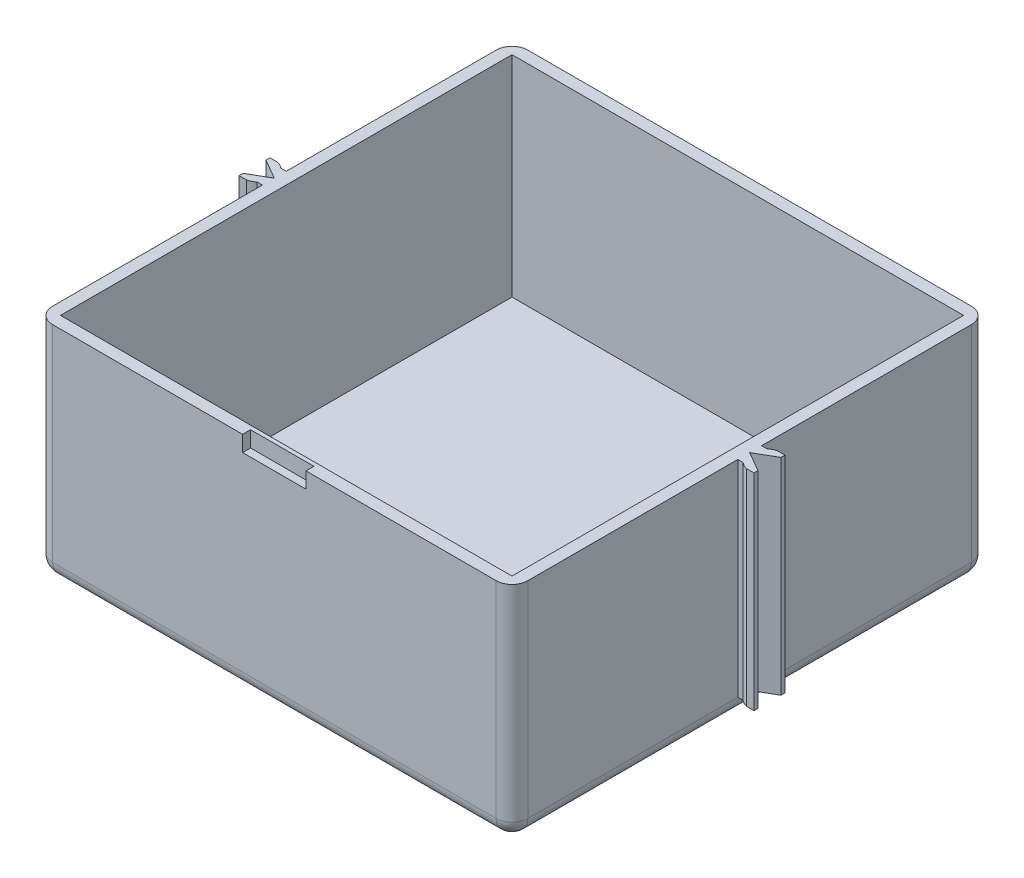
ISO-10303-21;
HEADER;
FILE_DESCRIPTION(('STEP AP214'),'2;1');
FILE_NAME('part.step','',(''),(''),'','','');
FILE_SCHEMA(('AUTOMOTIVE_DESIGN { 1 0 10303 214 1 1 1 1 }'));
ENDSEC;
DATA;
#1=APPLICATION_CONTEXT('core data for automotive mechanical design processes');
#2=APPLICATION_PROTOCOL_DEFINITION('international standard','automotive_design',2000,#1);
#3=PRODUCT_CONTEXT('',#1,'mechanical');
#4=PRODUCT('Part','Part','',(#3));
#5=PRODUCT_RELATED_PRODUCT_CATEGORY('part','',(#4));
#6=PRODUCT_DEFINITION_FORMATION('','',#4);
#7=PRODUCT_DEFINITION_CONTEXT('part definition',#1,'design');
#8=PRODUCT_DEFINITION('design','',#6,#7);
#9=PRODUCT_DEFINITION_SHAPE('','',#8);
#10=(LENGTH_UNIT() NAMED_UNIT(*) SI_UNIT(.MILLI.,.METRE.));
#11=(NAMED_UNIT(*) PLANE_ANGLE_UNIT() SI_UNIT($,.RADIAN.));
#12=(NAMED_UNIT(*) SI_UNIT($,.STERADIAN.) SOLID_ANGLE_UNIT());
#13=UNCERTAINTY_MEASURE_WITH_UNIT(LENGTH_MEASURE(1.E-05),#10,'distance_accuracy_value','');
#14=(GEOMETRIC_REPRESENTATION_CONTEXT(3) GLOBAL_UNCERTAINTY_ASSIGNED_CONTEXT((#13)) GLOBAL_UNIT_ASSIGNED_CONTEXT((#10,
#11,#12)) REPRESENTATION_CONTEXT('',''));
#15=CARTESIAN_POINT('',(0.,0.,0.));
#16=DIRECTION('',(0.,0.,1.));
#17=DIRECTION('',(1.,0.,0.));
#18=AXIS2_PLACEMENT_3D('',#15,#16,#17);
#19=CARTESIAN_POINT('',(30.,28.,-30.));
#20=DIRECTION('',(-1.,0.,0.));
#21=DIRECTION('',(0.,0.,1.));
#22=AXIS2_PLACEMENT_3D('',#19,#20,#21);
#23=PLANE('',#22);
#24=DIRECTION('',(0.,-1.,0.));
#25=VECTOR('',#24,1.);
#26=CARTESIAN_POINT('',(30.,28.,28.));
#27=LINE('',#26,#25);
#28=CARTESIAN_POINT('',(30.,28.,28.));
#29=VERTEX_POINT('',#28);
#30=CARTESIAN_POINT('',(30.,2.,28.));
#31=VERTEX_POINT('',#30);
#32=EDGE_CURVE('E452',#29,#31,#27,.T.);
#33=ORIENTED_EDGE('',*,*,#32,.T.);
#34=DIRECTION('',(0.,0.,-1.));
#35=VECTOR('',#34,1.);
#36=CARTESIAN_POINT('',(30.,2.,-30.));
#37=LINE('',#36,#35);
#38=CARTESIAN_POINT('',(30.,2.,1.5));
#39=VERTEX_POINT('',#38);
#40=EDGE_CURVE('E454',#31,#39,#37,.T.);
#41=ORIENTED_EDGE('',*,*,#40,.T.);
#42=DIRECTION('',(0.,1.,0.));
#43=VECTOR('',#42,1.);
#44=CARTESIAN_POINT('',(30.,2.,1.5));
#45=LINE('',#44,#43);
#46=CARTESIAN_POINT('',(30.,28.,1.5));
#47=VERTEX_POINT('',#46);
#48=EDGE_CURVE('E405',#39,#47,#45,.T.);
#49=ORIENTED_EDGE('',*,*,#48,.T.);
#50=DIRECTION('',(0.,0.,-1.));
#51=VECTOR('',#50,1.);
#52=CARTESIAN_POINT('',(30.,28.,-30.));
#53=LINE('',#52,#51);
#54=EDGE_CURVE('E432',#29,#47,#53,.T.);
#55=ORIENTED_EDGE('',*,*,#54,.F.);
#56=EDGE_LOOP('',(#33,#41,#49,#55));
#57=FACE_BOUND('',#56,.T.);
#58=ADVANCED_FACE('F34',(#57),#23,.F.);
#59=CARTESIAN_POINT('',(-30.,28.,-30.));
#60=DIRECTION('',(1.,0.,0.));
#61=DIRECTION('',(0.,0.,-1.));
#62=AXIS2_PLACEMENT_3D('',#59,#60,#61);
#63=PLANE('',#62);
#64=DIRECTION('',(0.,1.,0.));
#65=VECTOR('',#64,1.);
#66=CARTESIAN_POINT('',(-30.,2.,1.5));
#67=LINE('',#66,#65);
#68=CARTESIAN_POINT('',(-30.,2.,1.5));
#69=VERTEX_POINT('',#68);
#70=CARTESIAN_POINT('',(-30.,28.,1.5));
#71=VERTEX_POINT('',#70);
#72=EDGE_CURVE('E1149',#69,#71,#67,.T.);
#73=ORIENTED_EDGE('',*,*,#72,.F.);
#74=DIRECTION('',(0.,0.,1.));
#75=VECTOR('',#74,1.);
#76=CARTESIAN_POINT('',(-30.,2.,-30.));
#77=LINE('',#76,#75);
#78=CARTESIAN_POINT('',(-30.,2.,28.));
#79=VERTEX_POINT('',#78);
#80=EDGE_CURVE('E551',#69,#79,#77,.T.);
#81=ORIENTED_EDGE('',*,*,#80,.T.);
#82=DIRECTION('',(0.,-1.,0.));
#83=VECTOR('',#82,1.);
#84=CARTESIAN_POINT('',(-30.,28.,28.));
#85=LINE('',#84,#83);
#86=CARTESIAN_POINT('',(-30.,28.,28.));
#87=VERTEX_POINT('',#86);
#88=EDGE_CURVE('E549',#79,#87,#85,.F.);
#89=ORIENTED_EDGE('',*,*,#88,.T.);
#90=DIRECTION('',(0.,0.,1.));
#91=VECTOR('',#90,1.);
#92=CARTESIAN_POINT('',(-30.,28.,-30.));
#93=LINE('',#92,#91);
#94=EDGE_CURVE('E439',#71,#87,#93,.T.);
#95=ORIENTED_EDGE('',*,*,#94,.F.);
#96=EDGE_LOOP('',(#73,#81,#89,#95));
#97=FACE_BOUND('',#96,.T.);
#98=ADVANCED_FACE('F639',(#97),#63,.F.);
#99=DIRECTION('',(0.,1.,0.));
#100=VECTOR('',#99,1.);
#101=CARTESIAN_POINT('',(30.,2.,-1.5));
#102=LINE('',#101,#100);
#103=CARTESIAN_POINT('',(30.,2.,-1.5));
#104=VERTEX_POINT('',#103);
#105=CARTESIAN_POINT('',(30.,28.,-1.5));
#106=VERTEX_POINT('',#105);
#107=EDGE_CURVE('E359',#104,#106,#102,.T.);
#108=ORIENTED_EDGE('',*,*,#107,.F.);
#109=DIRECTION('',(0.,0.,-1.));
#110=VECTOR('',#109,1.);
#111=CARTESIAN_POINT('',(30.,2.,-30.));
#112=LINE('',#111,#110);
#113=CARTESIAN_POINT('',(30.,2.,-28.));
#114=VERTEX_POINT('',#113);
#115=EDGE_CURVE('E450',#104,#114,#112,.T.);
#116=ORIENTED_EDGE('',*,*,#115,.T.);
#117=DIRECTION('',(0.,-1.,0.));
#118=VECTOR('',#117,1.);
#119=CARTESIAN_POINT('',(30.,28.,-28.));
#120=LINE('',#119,#118);
#121=CARTESIAN_POINT('',(30.,28.,-28.));
#122=VERTEX_POINT('',#121);
#123=EDGE_CURVE('E448',#114,#122,#120,.F.);
#124=ORIENTED_EDGE('',*,*,#123,.T.);
#125=EDGE_CURVE('E428',#106,#122,#53,.T.);
#126=ORIENTED_EDGE('',*,*,#125,.F.);
#127=EDGE_LOOP('',(#108,#116,#124,#126));
#128=FACE_BOUND('',#127,.T.);
#129=ADVANCED_FACE('F629',(#128),#23,.F.);
#130=DIRECTION('',(0.,-1.,0.));
#131=VECTOR('',#130,1.);
#132=CARTESIAN_POINT('',(-30.,28.,-28.));
#133=LINE('',#132,#131);
#134=CARTESIAN_POINT('',(-30.,28.,-28.));
#135=VERTEX_POINT('',#134);
#136=CARTESIAN_POINT('',(-30.,2.,-28.));
#137=VERTEX_POINT('',#136);
#138=EDGE_CURVE('E518',#135,#137,#133,.T.);
#139=ORIENTED_EDGE('',*,*,#138,.T.);
#140=DIRECTION('',(0.,0.,1.));
#141=VECTOR('',#140,1.);
#142=CARTESIAN_POINT('',(-30.,2.,-30.));
#143=LINE('',#142,#141);
#144=CARTESIAN_POINT('',(-30.,2.,-1.5));
#145=VERTEX_POINT('',#144);
#146=EDGE_CURVE('E546',#137,#145,#143,.T.);
#147=ORIENTED_EDGE('',*,*,#146,.T.);
#148=DIRECTION('',(0.,1.,0.));
#149=VECTOR('',#148,1.);
#150=CARTESIAN_POINT('',(-30.,2.,-1.5));
#151=LINE('',#150,#149);
#152=CARTESIAN_POINT('',(-30.,28.,-1.50000000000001));
#153=VERTEX_POINT('',#152);
#154=EDGE_CURVE('E1090',#145,#153,#151,.T.);
#155=ORIENTED_EDGE('',*,*,#154,.T.);
#156=EDGE_CURVE('E531',#135,#153,#93,.T.);
#157=ORIENTED_EDGE('',*,*,#156,.F.);
#158=EDGE_LOOP('',(#139,#147,#155,#157));
#159=FACE_BOUND('',#158,.T.);
#160=ADVANCED_FACE('F646',(#159),#63,.F.);
#161=CARTESIAN_POINT('',(30.,28.,-30.));
#162=DIRECTION('',(0.,0.,1.));
#163=DIRECTION('',(1.,0.,0.));
#164=AXIS2_PLACEMENT_3D('',#161,#162,#163);
#165=PLANE('',#164);
#166=DIRECTION('',(-1.,0.,0.));
#167=VECTOR('',#166,1.);
#168=CARTESIAN_POINT('',(30.,28.,-30.));
#169=LINE('',#168,#167);
#170=CARTESIAN_POINT('',(28.,28.,-30.));
#171=VERTEX_POINT('',#170);
#172=CARTESIAN_POINT('',(-28.,28.,-30.));
#173=VERTEX_POINT('',#172);
#174=EDGE_CURVE('E521',#171,#173,#169,.T.);
#175=ORIENTED_EDGE('',*,*,#174,.F.);
#176=DIRECTION('',(0.,-1.,0.));
#177=VECTOR('',#176,1.);
#178=CARTESIAN_POINT('',(28.,28.,-30.));
#179=LINE('',#178,#177);
#180=CARTESIAN_POINT('',(28.,2.,-30.));
#181=VERTEX_POINT('',#180);
#182=EDGE_CURVE('E51',#171,#181,#179,.T.);
#183=ORIENTED_EDGE('',*,*,#182,.T.);
#184=DIRECTION('',(-1.,0.,0.));
#185=VECTOR('',#184,1.);
#186=CARTESIAN_POINT('',(30.,2.,-30.));
#187=LINE('',#186,#185);
#188=CARTESIAN_POINT('',(-28.,2.,-30.));
#189=VERTEX_POINT('',#188);
#190=EDGE_CURVE('E56',#181,#189,#187,.T.);
#191=ORIENTED_EDGE('',*,*,#190,.T.);
#192=DIRECTION('',(0.,-1.,0.));
#193=VECTOR('',#192,1.);
#194=CARTESIAN_POINT('',(-28.,28.,-30.));
#195=LINE('',#194,#193);
#196=EDGE_CURVE('E456',#189,#173,#195,.F.);
#197=ORIENTED_EDGE('',*,*,#196,.T.);
#198=EDGE_LOOP('',(#175,#183,#191,#197));
#199=FACE_BOUND('',#198,.T.);
#200=ADVANCED_FACE('F520',(#199),#165,.F.);
#201=CARTESIAN_POINT('',(30.,28.,30.));
#202=DIRECTION('',(0.,0.,-1.));
#203=DIRECTION('',(-1.,0.,0.));
#204=AXIS2_PLACEMENT_3D('',#201,#202,#203);
#205=PLANE('',#204);
#206=DIRECTION('',(1.,0.,0.));
#207=VECTOR('',#206,1.);
#208=CARTESIAN_POINT('',(30.,2.,30.));
#209=LINE('',#208,#207);
#210=CARTESIAN_POINT('',(-28.,2.,30.));
#211=VERTEX_POINT('',#210);
#212=CARTESIAN_POINT('',(28.,2.,30.));
#213=VERTEX_POINT('',#212);
#214=EDGE_CURVE('E561',#211,#213,#209,.T.);
#215=ORIENTED_EDGE('',*,*,#214,.T.);
#216=DIRECTION('',(0.,-1.,0.));
#217=VECTOR('',#216,1.);
#218=CARTESIAN_POINT('',(28.,28.,30.));
#219=LINE('',#218,#217);
#220=CARTESIAN_POINT('',(28.,28.,30.));
#221=VERTEX_POINT('',#220);
#222=EDGE_CURVE('E446',#213,#221,#219,.F.);
#223=ORIENTED_EDGE('',*,*,#222,.T.);
#224=DIRECTION('',(1.,0.,0.));
#225=VECTOR('',#224,1.);
#226=CARTESIAN_POINT('',(30.,28.,30.));
#227=LINE('',#226,#225);
#228=CARTESIAN_POINT('',(4.00000000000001,28.,30.));
#229=VERTEX_POINT('',#228);
#230=EDGE_CURVE('E542',#229,#221,#227,.T.);
#231=ORIENTED_EDGE('',*,*,#230,.F.);
#232=DIRECTION('',(0.,-1.,0.));
#233=VECTOR('',#232,1.);
#234=CARTESIAN_POINT('',(4.00000000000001,28.,30.));
#235=LINE('',#234,#233);
#236=CARTESIAN_POINT('',(4.00000000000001,26.,30.));
#237=VERTEX_POINT('',#236);
#238=EDGE_CURVE('E325',#229,#237,#235,.T.);
#239=ORIENTED_EDGE('',*,*,#238,.T.);
#240=DIRECTION('',(1.,0.,0.));
#241=VECTOR('',#240,1.);
#242=CARTESIAN_POINT('',(30.,26.,30.));
#243=LINE('',#242,#241);
#244=CARTESIAN_POINT('',(-3.99999999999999,26.,30.));
#245=VERTEX_POINT('',#244);
#246=EDGE_CURVE('E543',#245,#237,#243,.T.);
#247=ORIENTED_EDGE('',*,*,#246,.F.);
#248=DIRECTION('',(0.,1.,0.));
#249=VECTOR('',#248,1.);
#250=CARTESIAN_POINT('',(-3.99999999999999,28.,30.));
#251=LINE('',#250,#249);
#252=CARTESIAN_POINT('',(-3.99999999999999,28.,30.));
#253=VERTEX_POINT('',#252);
#254=EDGE_CURVE('E310',#245,#253,#251,.T.);
#255=ORIENTED_EDGE('',*,*,#254,.T.);
#256=CARTESIAN_POINT('',(-28.,28.,30.));
#257=VERTEX_POINT('',#256);
#258=EDGE_CURVE('E433',#257,#253,#227,.T.);
#259=ORIENTED_EDGE('',*,*,#258,.F.);
#260=DIRECTION('',(0.,-1.,0.));
#261=VECTOR('',#260,1.);
#262=CARTESIAN_POINT('',(-28.,28.,30.));
#263=LINE('',#262,#261);
#264=EDGE_CURVE('E560',#257,#211,#263,.T.);
#265=ORIENTED_EDGE('',*,*,#264,.T.);
#266=EDGE_LOOP('',(#215,#223,#231,#239,#247,#255,#259,#265));
#267=FACE_BOUND('',#266,.T.);
#268=ADVANCED_FACE('F566',(#267),#205,.F.);
#269=CARTESIAN_POINT('',(0.,28.,0.));
#270=DIRECTION('',(0.,1.,0.));
#271=DIRECTION('',(0.,0.,1.));
#272=AXIS2_PLACEMENT_3D('',#269,#270,#271);
#273=PLANE('',#272);
#274=ORIENTED_EDGE('',*,*,#230,.T.);
#275=CARTESIAN_POINT('',(28.,28.,28.));
#276=DIRECTION('',(0.,1.,0.));
#277=DIRECTION('',(0.,0.,1.));
#278=AXIS2_PLACEMENT_3D('',#275,#276,#277);
#279=CIRCLE('',#278,2.);
#280=EDGE_CURVE('E11',#221,#29,#279,.T.);
#281=ORIENTED_EDGE('',*,*,#280,.T.);
#282=ORIENTED_EDGE('',*,*,#54,.T.);
#283=DIRECTION('',(-1.,0.,0.));
#284=VECTOR('',#283,1.);
#285=CARTESIAN_POINT('',(30.,28.,1.5));
#286=LINE('',#285,#284);
#287=CARTESIAN_POINT('',(30.6771243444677,28.,1.5));
#288=VERTEX_POINT('',#287);
#289=EDGE_CURVE('E389',#288,#47,#286,.T.);
#290=ORIENTED_EDGE('',*,*,#289,.F.);
#291=CARTESIAN_POINT('',(32.,28.,0.));
#292=DIRECTION('',(0.,-1.,0.));
#293=DIRECTION('',(0.,0.,1.));
#294=AXIS2_PLACEMENT_3D('',#291,#292,#293);
#295=CIRCLE('',#294,2.);
#296=CARTESIAN_POINT('',(31.5555902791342,28.,1.95));
#297=VERTEX_POINT('',#296);
#298=EDGE_CURVE('E386',#297,#288,#295,.T.);
#299=ORIENTED_EDGE('',*,*,#298,.F.);
#300=DIRECTION('',(-1.,0.,0.));
#301=VECTOR('',#300,1.);
#302=CARTESIAN_POINT('',(32.5,28.,1.95));
#303=LINE('',#302,#301);
#304=CARTESIAN_POINT('',(32.5,28.,1.95));
#305=VERTEX_POINT('',#304);
#306=EDGE_CURVE('E388',#305,#297,#303,.T.);
#307=ORIENTED_EDGE('',*,*,#306,.F.);
#308=DIRECTION('',(0.,0.,1.));
#309=VECTOR('',#308,1.);
#310=CARTESIAN_POINT('',(32.5,28.,1.44337567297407));
#311=LINE('',#310,#309);
#312=CARTESIAN_POINT('',(32.5,28.,1.44337567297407));
#313=VERTEX_POINT('',#312);
#314=EDGE_CURVE('E373',#313,#305,#311,.T.);
#315=ORIENTED_EDGE('',*,*,#314,.F.);
#316=DIRECTION('',(0.866025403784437,0.,0.500000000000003));
#317=VECTOR('',#316,1.);
#318=CARTESIAN_POINT('',(30.,28.,0.));
#319=LINE('',#318,#317);
#320=CARTESIAN_POINT('',(30.,28.,0.));
#321=VERTEX_POINT('',#320);
#322=EDGE_CURVE('E361',#321,#313,#319,.T.);
#323=ORIENTED_EDGE('',*,*,#322,.F.);
#324=DIRECTION('',(0.866025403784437,0.,-0.500000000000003));
#325=VECTOR('',#324,1.);
#326=CARTESIAN_POINT('',(30.,28.,0.));
#327=LINE('',#326,#325);
#328=CARTESIAN_POINT('',(32.5,28.,-1.44337567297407));
#329=VERTEX_POINT('',#328);
#330=EDGE_CURVE('E328',#321,#329,#327,.T.);
#331=ORIENTED_EDGE('',*,*,#330,.T.);
#332=DIRECTION('',(0.,0.,-1.));
#333=VECTOR('',#332,1.);
#334=CARTESIAN_POINT('',(32.5,28.,-1.44337567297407));
#335=LINE('',#334,#333);
#336=CARTESIAN_POINT('',(32.5,28.,-1.95));
#337=VERTEX_POINT('',#336);
#338=EDGE_CURVE('E348',#329,#337,#335,.T.);
#339=ORIENTED_EDGE('',*,*,#338,.T.);
#340=DIRECTION('',(-1.,0.,0.));
#341=VECTOR('',#340,1.);
#342=CARTESIAN_POINT('',(32.5,28.,-1.95));
#343=LINE('',#342,#341);
#344=CARTESIAN_POINT('',(31.5555902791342,28.,-1.95));
#345=VERTEX_POINT('',#344);
#346=EDGE_CURVE('E351',#337,#345,#343,.T.);
#347=ORIENTED_EDGE('',*,*,#346,.T.);
#348=CARTESIAN_POINT('',(32.,28.,0.));
#349=DIRECTION('',(0.,1.,0.));
#350=DIRECTION('',(0.,0.,-1.));
#351=AXIS2_PLACEMENT_3D('',#348,#349,#350);
#352=CIRCLE('',#351,2.);
#353=CARTESIAN_POINT('',(30.6771243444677,28.,-1.5));
#354=VERTEX_POINT('',#353);
#355=EDGE_CURVE('E354',#345,#354,#352,.T.);
#356=ORIENTED_EDGE('',*,*,#355,.T.);
#357=DIRECTION('',(-1.,0.,0.));
#358=VECTOR('',#357,1.);
#359=CARTESIAN_POINT('',(30.,28.,-1.5));
#360=LINE('',#359,#358);
#361=EDGE_CURVE('E333',#354,#106,#360,.T.);
#362=ORIENTED_EDGE('',*,*,#361,.T.);
#363=ORIENTED_EDGE('',*,*,#125,.T.);
#364=CARTESIAN_POINT('',(28.,28.,-28.));
#365=DIRECTION('',(0.,1.,0.));
#366=DIRECTION('',(0.,0.,1.));
#367=AXIS2_PLACEMENT_3D('',#364,#365,#366);
#368=CIRCLE('',#367,2.);
#369=EDGE_CURVE('E462',#122,#171,#368,.T.);
#370=ORIENTED_EDGE('',*,*,#369,.T.);
#371=ORIENTED_EDGE('',*,*,#174,.T.);
#372=CARTESIAN_POINT('',(-28.,28.,-28.));
#373=DIRECTION('',(0.,1.,0.));
#374=DIRECTION('',(0.,0.,1.));
#375=AXIS2_PLACEMENT_3D('',#372,#373,#374);
#376=CIRCLE('',#375,2.);
#377=EDGE_CURVE('E460',#173,#135,#376,.T.);
#378=ORIENTED_EDGE('',*,*,#377,.T.);
#379=ORIENTED_EDGE('',*,*,#156,.T.);
#380=DIRECTION('',(1.,0.,0.));
#381=VECTOR('',#380,1.);
#382=CARTESIAN_POINT('',(-30.,28.,-1.5));
#383=LINE('',#382,#381);
#384=CARTESIAN_POINT('',(-30.6771243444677,28.,-1.5));
#385=VERTEX_POINT('',#384);
#386=EDGE_CURVE('E1084',#385,#153,#383,.T.);
#387=ORIENTED_EDGE('',*,*,#386,.F.);
#388=CARTESIAN_POINT('',(-32.,28.,0.));
#389=DIRECTION('',(0.,-1.,0.));
#390=DIRECTION('',(0.,0.,-1.));
#391=AXIS2_PLACEMENT_3D('',#388,#389,#390);
#392=CIRCLE('',#391,2.);
#393=CARTESIAN_POINT('',(-31.5555902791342,28.,-1.95));
#394=VERTEX_POINT('',#393);
#395=EDGE_CURVE('E1074',#394,#385,#392,.T.);
#396=ORIENTED_EDGE('',*,*,#395,.F.);
#397=DIRECTION('',(1.,0.,0.));
#398=VECTOR('',#397,1.);
#399=CARTESIAN_POINT('',(-32.5,28.,-1.95));
#400=LINE('',#399,#398);
#401=CARTESIAN_POINT('',(-32.5,28.,-1.95));
#402=VERTEX_POINT('',#401);
#403=EDGE_CURVE('E1083',#402,#394,#400,.T.);
#404=ORIENTED_EDGE('',*,*,#403,.F.);
#405=DIRECTION('',(0.,0.,-1.));
#406=VECTOR('',#405,1.);
#407=CARTESIAN_POINT('',(-32.5,28.,-1.44337567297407));
#408=LINE('',#407,#406);
#409=CARTESIAN_POINT('',(-32.5,28.,-1.44337567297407));
#410=VERTEX_POINT('',#409);
#411=EDGE_CURVE('E1100',#410,#402,#408,.T.);
#412=ORIENTED_EDGE('',*,*,#411,.F.);
#413=DIRECTION('',(-0.866025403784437,0.,-0.500000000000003));
#414=VECTOR('',#413,1.);
#415=CARTESIAN_POINT('',(-30.,28.,0.));
#416=LINE('',#415,#414);
#417=CARTESIAN_POINT('',(-30.,28.,0.));
#418=VERTEX_POINT('',#417);
#419=EDGE_CURVE('E395',#418,#410,#416,.T.);
#420=ORIENTED_EDGE('',*,*,#419,.F.);
#421=DIRECTION('',(-0.866025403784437,0.,0.500000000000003));
#422=VECTOR('',#421,1.);
#423=CARTESIAN_POINT('',(-30.,28.,0.));
#424=LINE('',#423,#422);
#425=CARTESIAN_POINT('',(-32.5,28.,1.44337567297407));
#426=VERTEX_POINT('',#425);
#427=EDGE_CURVE('E1105',#418,#426,#424,.T.);
#428=ORIENTED_EDGE('',*,*,#427,.T.);
#429=DIRECTION('',(0.,0.,1.));
#430=VECTOR('',#429,1.);
#431=CARTESIAN_POINT('',(-32.5,28.,1.44337567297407));
#432=LINE('',#431,#430);
#433=CARTESIAN_POINT('',(-32.5,28.,1.95));
#434=VERTEX_POINT('',#433);
#435=EDGE_CURVE('E1130',#426,#434,#432,.T.);
#436=ORIENTED_EDGE('',*,*,#435,.T.);
#437=DIRECTION('',(1.,0.,0.));
#438=VECTOR('',#437,1.);
#439=CARTESIAN_POINT('',(-32.5,28.,1.95));
#440=LINE('',#439,#438);
#441=CARTESIAN_POINT('',(-31.5555902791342,28.,1.95));
#442=VERTEX_POINT('',#441);
#443=EDGE_CURVE('E1133',#434,#442,#440,.T.);
#444=ORIENTED_EDGE('',*,*,#443,.T.);
#445=CARTESIAN_POINT('',(-32.,28.,0.));
#446=DIRECTION('',(0.,1.,0.));
#447=DIRECTION('',(0.,0.,1.));
#448=AXIS2_PLACEMENT_3D('',#445,#446,#447);
#449=CIRCLE('',#448,2.);
#450=CARTESIAN_POINT('',(-30.6771243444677,28.,1.5));
#451=VERTEX_POINT('',#450);
#452=EDGE_CURVE('E1136',#442,#451,#449,.T.);
#453=ORIENTED_EDGE('',*,*,#452,.T.);
#454=DIRECTION('',(1.,0.,0.));
#455=VECTOR('',#454,1.);
#456=CARTESIAN_POINT('',(-30.,28.,1.5));
#457=LINE('',#456,#455);
#458=EDGE_CURVE('E1115',#451,#71,#457,.T.);
#459=ORIENTED_EDGE('',*,*,#458,.T.);
#460=ORIENTED_EDGE('',*,*,#94,.T.);
#461=CARTESIAN_POINT('',(-28.,28.,28.));
#462=DIRECTION('',(0.,1.,0.));
#463=DIRECTION('',(0.,0.,1.));
#464=AXIS2_PLACEMENT_3D('',#461,#462,#463);
#465=CIRCLE('',#464,2.);
#466=EDGE_CURVE('E43',#87,#257,#465,.T.);
#467=ORIENTED_EDGE('',*,*,#466,.T.);
#468=ORIENTED_EDGE('',*,*,#258,.T.);
#469=DIRECTION('',(0.,0.,1.));
#470=VECTOR('',#469,1.);
#471=CARTESIAN_POINT('',(-3.99999999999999,28.,29.));
#472=LINE('',#471,#470);
#473=CARTESIAN_POINT('',(-3.99999999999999,28.,29.));
#474=VERTEX_POINT('',#473);
#475=EDGE_CURVE('E317',#474,#253,#472,.T.);
#476=ORIENTED_EDGE('',*,*,#475,.F.);
#477=DIRECTION('',(-1.,0.,0.));
#478=VECTOR('',#477,1.);
#479=CARTESIAN_POINT('',(4.00000000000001,28.,29.));
#480=LINE('',#479,#478);
#481=CARTESIAN_POINT('',(4.00000000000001,28.,29.));
#482=VERTEX_POINT('',#481);
#483=EDGE_CURVE('E299',#482,#474,#480,.T.);
#484=ORIENTED_EDGE('',*,*,#483,.F.);
#485=DIRECTION('',(0.,0.,-1.));
#486=VECTOR('',#485,1.);
#487=CARTESIAN_POINT('',(4.00000000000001,28.,0.));
#488=LINE('',#487,#486);
#489=EDGE_CURVE('E445',#229,#482,#488,.T.);
#490=ORIENTED_EDGE('',*,*,#489,.F.);
#491=EDGE_LOOP('',(#274,#281,#282,#290,#299,#307,#315,#323,#331,#339,#347,#356,#362,#363,#370,
#371,#378,#379,#387,#396,#404,#412,#420,#428,#436,#444,#453,#459,#460,#467,#468,#476,#484,#490));
#492=FACE_BOUND('',#491,.T.);
#493=DIRECTION('',(0.,0.,-1.));
#494=VECTOR('',#493,1.);
#495=CARTESIAN_POINT('',(28.5,28.,28.5));
#496=LINE('',#495,#494);
#497=CARTESIAN_POINT('',(28.5,28.,28.5));
#498=VERTEX_POINT('',#497);
#499=CARTESIAN_POINT('',(28.5,28.,-28.5));
#500=VERTEX_POINT('',#499);
#501=EDGE_CURVE('E1148',#498,#500,#496,.T.);
#502=ORIENTED_EDGE('',*,*,#501,.F.);
#503=DIRECTION('',(1.,0.,0.));
#504=VECTOR('',#503,1.);
#505=CARTESIAN_POINT('',(-28.5,28.,28.5));
#506=LINE('',#505,#504);
#507=CARTESIAN_POINT('',(-28.5,28.,28.5));
#508=VERTEX_POINT('',#507);
#509=EDGE_CURVE('E1200',#508,#498,#506,.T.);
#510=ORIENTED_EDGE('',*,*,#509,.F.);
#511=DIRECTION('',(0.,0.,1.));
#512=VECTOR('',#511,1.);
#513=CARTESIAN_POINT('',(-28.5,28.,-28.5));
#514=LINE('',#513,#512);
#515=CARTESIAN_POINT('',(-28.5,28.,-28.5));
#516=VERTEX_POINT('',#515);
#517=EDGE_CURVE('E1213',#516,#508,#514,.T.);
#518=ORIENTED_EDGE('',*,*,#517,.F.);
#519=DIRECTION('',(-1.,0.,0.));
#520=VECTOR('',#519,1.);
#521=CARTESIAN_POINT('',(28.5,28.,-28.5));
#522=LINE('',#521,#520);
#523=EDGE_CURVE('E1210',#500,#516,#522,.T.);
#524=ORIENTED_EDGE('',*,*,#523,.F.);
#525=EDGE_LOOP('',(#502,#510,#518,#524));
#526=FACE_BOUND('',#525,.T.);
#527=ADVANCED_FACE('F524',(#492,#526),#273,.T.);
#528=CARTESIAN_POINT('',(0.,0.,0.));
#529=DIRECTION('',(0.,1.,0.));
#530=DIRECTION('',(0.,0.,1.));
#531=AXIS2_PLACEMENT_3D('',#528,#529,#530);
#532=PLANE('',#531);
#533=DIRECTION('',(1.,0.,0.));
#534=VECTOR('',#533,1.);
#535=CARTESIAN_POINT('',(0.,0.,28.));
#536=LINE('',#535,#534);
#537=CARTESIAN_POINT('',(28.,0.,28.));
#538=VERTEX_POINT('',#537);
#539=CARTESIAN_POINT('',(-28.,0.,28.));
#540=VERTEX_POINT('',#539);
#541=EDGE_CURVE('E556',#538,#540,#536,.F.);
#542=ORIENTED_EDGE('',*,*,#541,.T.);
#543=DIRECTION('',(0.,0.,1.));
#544=VECTOR('',#543,1.);
#545=CARTESIAN_POINT('',(-28.,0.,0.));
#546=LINE('',#545,#544);
#547=CARTESIAN_POINT('',(-28.,0.,-28.));
#548=VERTEX_POINT('',#547);
#549=EDGE_CURVE('E558',#540,#548,#546,.F.);
#550=ORIENTED_EDGE('',*,*,#549,.T.);
#551=DIRECTION('',(-1.,0.,0.));
#552=VECTOR('',#551,1.);
#553=CARTESIAN_POINT('',(0.,0.,-28.));
#554=LINE('',#553,#552);
#555=CARTESIAN_POINT('',(28.,0.,-28.));
#556=VERTEX_POINT('',#555);
#557=EDGE_CURVE('E507',#548,#556,#554,.F.);
#558=ORIENTED_EDGE('',*,*,#557,.T.);
#559=DIRECTION('',(0.,0.,-1.));
#560=VECTOR('',#559,1.);
#561=CARTESIAN_POINT('',(28.,0.,0.));
#562=LINE('',#561,#560);
#563=EDGE_CURVE('E554',#556,#538,#562,.F.);
#564=ORIENTED_EDGE('',*,*,#563,.T.);
#565=EDGE_LOOP('',(#542,#550,#558,#564));
#566=FACE_BOUND('',#565,.T.);
#567=ADVANCED_FACE('F848',(#566),#532,.F.);
#568=CARTESIAN_POINT('',(28.5,1.5,28.5));
#569=DIRECTION('',(1.,0.,0.));
#570=DIRECTION('',(0.,0.,-1.));
#571=AXIS2_PLACEMENT_3D('',#568,#569,#570);
#572=PLANE('',#571);
#573=ORIENTED_EDGE('',*,*,#501,.T.);
#574=DIRECTION('',(0.,1.,0.));
#575=VECTOR('',#574,1.);
#576=CARTESIAN_POINT('',(28.5,1.5,-28.5));
#577=LINE('',#576,#575);
#578=CARTESIAN_POINT('',(28.5,1.5,-28.5));
#579=VERTEX_POINT('',#578);
#580=EDGE_CURVE('E535',#579,#500,#577,.T.);
#581=ORIENTED_EDGE('',*,*,#580,.F.);
#582=DIRECTION('',(0.,0.,-1.));
#583=VECTOR('',#582,1.);
#584=CARTESIAN_POINT('',(28.5,1.5,28.5));
#585=LINE('',#584,#583);
#586=CARTESIAN_POINT('',(28.5,1.5,28.5));
#587=VERTEX_POINT('',#586);
#588=EDGE_CURVE('E1196',#587,#579,#585,.T.);
#589=ORIENTED_EDGE('',*,*,#588,.F.);
#590=DIRECTION('',(0.,1.,0.));
#591=VECTOR('',#590,1.);
#592=CARTESIAN_POINT('',(28.5,1.5,28.5));
#593=LINE('',#592,#591);
#594=EDGE_CURVE('E528',#587,#498,#593,.T.);
#595=ORIENTED_EDGE('',*,*,#594,.T.);
#596=EDGE_LOOP('',(#573,#581,#589,#595));
#597=FACE_BOUND('',#596,.T.);
#598=ADVANCED_FACE('F977',(#597),#572,.F.);
#599=CARTESIAN_POINT('',(-28.5,1.5,28.5));
#600=DIRECTION('',(0.,0.,1.));
#601=DIRECTION('',(1.,0.,0.));
#602=AXIS2_PLACEMENT_3D('',#599,#600,#601);
#603=PLANE('',#602);
#604=ORIENTED_EDGE('',*,*,#509,.T.);
#605=ORIENTED_EDGE('',*,*,#594,.F.);
#606=DIRECTION('',(1.,0.,0.));
#607=VECTOR('',#606,1.);
#608=CARTESIAN_POINT('',(-28.5,1.5,28.5));
#609=LINE('',#608,#607);
#610=CARTESIAN_POINT('',(-28.5,1.5,28.5));
#611=VERTEX_POINT('',#610);
#612=EDGE_CURVE('E1206',#611,#587,#609,.T.);
#613=ORIENTED_EDGE('',*,*,#612,.F.);
#614=DIRECTION('',(0.,1.,0.));
#615=VECTOR('',#614,1.);
#616=CARTESIAN_POINT('',(-28.5,1.5,28.5));
#617=LINE('',#616,#615);
#618=EDGE_CURVE('E532',#611,#508,#617,.T.);
#619=ORIENTED_EDGE('',*,*,#618,.T.);
#620=EDGE_LOOP('',(#604,#605,#613,#619));
#621=FACE_BOUND('',#620,.T.);
#622=ADVANCED_FACE('F990',(#621),#603,.F.);
#623=CARTESIAN_POINT('',(-28.5,1.5,-28.5));
#624=DIRECTION('',(-1.,0.,0.));
#625=DIRECTION('',(0.,0.,1.));
#626=AXIS2_PLACEMENT_3D('',#623,#624,#625);
#627=PLANE('',#626);
#628=ORIENTED_EDGE('',*,*,#517,.T.);
#629=ORIENTED_EDGE('',*,*,#618,.F.);
#630=DIRECTION('',(0.,0.,1.));
#631=VECTOR('',#630,1.);
#632=CARTESIAN_POINT('',(-28.5,1.5,-28.5));
#633=LINE('',#632,#631);
#634=CARTESIAN_POINT('',(-28.5,1.5,-28.5));
#635=VERTEX_POINT('',#634);
#636=EDGE_CURVE('E1203',#635,#611,#633,.T.);
#637=ORIENTED_EDGE('',*,*,#636,.F.);
#638=DIRECTION('',(0.,1.,0.));
#639=VECTOR('',#638,1.);
#640=CARTESIAN_POINT('',(-28.5,1.5,-28.5));
#641=LINE('',#640,#639);
#642=EDGE_CURVE('E1218',#635,#516,#641,.T.);
#643=ORIENTED_EDGE('',*,*,#642,.T.);
#644=EDGE_LOOP('',(#628,#629,#637,#643));
#645=FACE_BOUND('',#644,.T.);
#646=ADVANCED_FACE('F997',(#645),#627,.F.);
#647=CARTESIAN_POINT('',(28.5,1.5,-28.5));
#648=DIRECTION('',(0.,0.,-1.));
#649=DIRECTION('',(-1.,0.,0.));
#650=AXIS2_PLACEMENT_3D('',#647,#648,#649);
#651=PLANE('',#650);
#652=ORIENTED_EDGE('',*,*,#523,.T.);
#653=ORIENTED_EDGE('',*,*,#642,.F.);
#654=DIRECTION('',(-1.,0.,0.));
#655=VECTOR('',#654,1.);
#656=CARTESIAN_POINT('',(28.5,1.5,-28.5));
#657=LINE('',#656,#655);
#658=EDGE_CURVE('E1199',#579,#635,#657,.T.);
#659=ORIENTED_EDGE('',*,*,#658,.F.);
#660=ORIENTED_EDGE('',*,*,#580,.T.);
#661=EDGE_LOOP('',(#652,#653,#659,#660));
#662=FACE_BOUND('',#661,.T.);
#663=ADVANCED_FACE('F1005',(#662),#651,.F.);
#664=CARTESIAN_POINT('',(0.,1.5,0.));
#665=DIRECTION('',(0.,1.,0.));
#666=DIRECTION('',(0.,0.,1.));
#667=AXIS2_PLACEMENT_3D('',#664,#665,#666);
#668=PLANE('',#667);
#669=ORIENTED_EDGE('',*,*,#588,.T.);
#670=ORIENTED_EDGE('',*,*,#658,.T.);
#671=ORIENTED_EDGE('',*,*,#636,.T.);
#672=ORIENTED_EDGE('',*,*,#612,.T.);
#673=EDGE_LOOP('',(#669,#670,#671,#672));
#674=FACE_BOUND('',#673,.T.);
#675=ADVANCED_FACE('F966',(#674),#668,.T.);
#676=CARTESIAN_POINT('',(-30.,2.,0.));
#677=DIRECTION('',(-0.500000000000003,0.,-0.866025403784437));
#678=DIRECTION('',(-0.866025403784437,0.,0.500000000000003));
#679=AXIS2_PLACEMENT_3D('',#676,#677,#678);
#680=PLANE('',#679);
#681=ORIENTED_EDGE('',*,*,#427,.F.);
#682=DIRECTION('',(0.,1.,0.));
#683=VECTOR('',#682,1.);
#684=CARTESIAN_POINT('',(-30.,2.,0.));
#685=LINE('',#684,#683);
#686=CARTESIAN_POINT('',(-30.,2.,0.));
#687=VERTEX_POINT('',#686);
#688=EDGE_CURVE('E1144',#687,#418,#685,.T.);
#689=ORIENTED_EDGE('',*,*,#688,.F.);
#690=DIRECTION('',(-0.866025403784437,0.,0.500000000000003));
#691=VECTOR('',#690,1.);
#692=CARTESIAN_POINT('',(-30.,2.,0.));
#693=LINE('',#692,#691);
#694=CARTESIAN_POINT('',(-32.5,2.,1.44337567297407));
#695=VERTEX_POINT('',#694);
#696=EDGE_CURVE('E1111',#687,#695,#693,.T.);
#697=ORIENTED_EDGE('',*,*,#696,.T.);
#698=DIRECTION('',(0.,1.,0.));
#699=VECTOR('',#698,1.);
#700=CARTESIAN_POINT('',(-32.5,2.,1.44337567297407));
#701=LINE('',#700,#699);
#702=EDGE_CURVE('E1129',#695,#426,#701,.T.);
#703=ORIENTED_EDGE('',*,*,#702,.T.);
#704=EDGE_LOOP('',(#681,#689,#697,#703));
#705=FACE_BOUND('',#704,.T.);
#706=ADVANCED_FACE('F955',(#705),#680,.T.);
#707=CARTESIAN_POINT('',(-30.,2.,1.5));
#708=DIRECTION('',(0.,0.,1.));
#709=DIRECTION('',(1.,0.,0.));
#710=AXIS2_PLACEMENT_3D('',#707,#708,#709);
#711=PLANE('',#710);
#712=ORIENTED_EDGE('',*,*,#458,.F.);
#713=DIRECTION('',(0.,1.,0.));
#714=VECTOR('',#713,1.);
#715=CARTESIAN_POINT('',(-30.6771243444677,2.,1.5));
#716=LINE('',#715,#714);
#717=CARTESIAN_POINT('',(-30.6771243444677,2.,1.5));
#718=VERTEX_POINT('',#717);
#719=EDGE_CURVE('E1141',#718,#451,#716,.T.);
#720=ORIENTED_EDGE('',*,*,#719,.F.);
#721=DIRECTION('',(1.,0.,0.));
#722=VECTOR('',#721,1.);
#723=CARTESIAN_POINT('',(-30.,2.,1.5));
#724=LINE('',#723,#722);
#725=EDGE_CURVE('E1124',#718,#69,#724,.T.);
#726=ORIENTED_EDGE('',*,*,#725,.T.);
#727=ORIENTED_EDGE('',*,*,#72,.T.);
#728=EDGE_LOOP('',(#712,#720,#726,#727));
#729=FACE_BOUND('',#728,.T.);
#730=ADVANCED_FACE('F949',(#729),#711,.T.);
#731=CARTESIAN_POINT('',(-32.,2.,0.));
#732=DIRECTION('',(0.,1.,0.));
#733=DIRECTION('',(0.,0.,1.));
#734=AXIS2_PLACEMENT_3D('',#731,#732,#733);
#735=CYLINDRICAL_SURFACE('',#734,2.);
#736=ORIENTED_EDGE('',*,*,#452,.F.);
#737=DIRECTION('',(0.,1.,0.));
#738=VECTOR('',#737,1.);
#739=CARTESIAN_POINT('',(-31.5555902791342,2.,1.95));
#740=LINE('',#739,#738);
#741=CARTESIAN_POINT('',(-31.5555902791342,2.,1.95));
#742=VERTEX_POINT('',#741);
#743=EDGE_CURVE('E1193',#742,#442,#740,.T.);
#744=ORIENTED_EDGE('',*,*,#743,.F.);
#745=CARTESIAN_POINT('',(-32.,2.,0.));
#746=DIRECTION('',(0.,1.,0.));
#747=DIRECTION('',(0.,0.,1.));
#748=AXIS2_PLACEMENT_3D('',#745,#746,#747);
#749=CIRCLE('',#748,2.);
#750=EDGE_CURVE('E1121',#742,#718,#749,.T.);
#751=ORIENTED_EDGE('',*,*,#750,.T.);
#752=ORIENTED_EDGE('',*,*,#719,.T.);
#753=EDGE_LOOP('',(#736,#744,#751,#752));
#754=FACE_BOUND('',#753,.T.);
#755=ADVANCED_FACE('F954',(#754),#735,.T.);
#756=CARTESIAN_POINT('',(-32.5,2.,1.95));
#757=DIRECTION('',(0.,0.,1.));
#758=DIRECTION('',(1.,0.,0.));
#759=AXIS2_PLACEMENT_3D('',#756,#757,#758);
#760=PLANE('',#759);
#761=ORIENTED_EDGE('',*,*,#443,.F.);
#762=DIRECTION('',(0.,1.,0.));
#763=VECTOR('',#762,1.);
#764=CARTESIAN_POINT('',(-32.5,2.,1.95));
#765=LINE('',#764,#763);
#766=CARTESIAN_POINT('',(-32.5,2.,1.95));
#767=VERTEX_POINT('',#766);
#768=EDGE_CURVE('E1190',#767,#434,#765,.T.);
#769=ORIENTED_EDGE('',*,*,#768,.F.);
#770=DIRECTION('',(1.,0.,0.));
#771=VECTOR('',#770,1.);
#772=CARTESIAN_POINT('',(-32.5,2.,1.95));
#773=LINE('',#772,#771);
#774=EDGE_CURVE('E1118',#767,#742,#773,.T.);
#775=ORIENTED_EDGE('',*,*,#774,.T.);
#776=ORIENTED_EDGE('',*,*,#743,.T.);
#777=EDGE_LOOP('',(#761,#769,#775,#776));
#778=FACE_BOUND('',#777,.T.);
#779=ADVANCED_FACE('F1027',(#778),#760,.T.);
#780=CARTESIAN_POINT('',(-32.5,2.,1.44337567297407));
#781=DIRECTION('',(-1.,0.,0.));
#782=DIRECTION('',(0.,0.,1.));
#783=AXIS2_PLACEMENT_3D('',#780,#781,#782);
#784=PLANE('',#783);
#785=ORIENTED_EDGE('',*,*,#435,.F.);
#786=ORIENTED_EDGE('',*,*,#702,.F.);
#787=DIRECTION('',(0.,0.,1.));
#788=VECTOR('',#787,1.);
#789=CARTESIAN_POINT('',(-32.5,2.,1.44337567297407));
#790=LINE('',#789,#788);
#791=EDGE_CURVE('E1114',#695,#767,#790,.T.);
#792=ORIENTED_EDGE('',*,*,#791,.T.);
#793=ORIENTED_EDGE('',*,*,#768,.T.);
#794=EDGE_LOOP('',(#785,#786,#792,#793));
#795=FACE_BOUND('',#794,.T.);
#796=ADVANCED_FACE('F940',(#795),#784,.T.);
#797=CARTESIAN_POINT('',(-32.,2.,0.));
#798=DIRECTION('',(0.,1.,0.));
#799=DIRECTION('',(0.,0.,1.));
#800=AXIS2_PLACEMENT_3D('',#797,#798,#799);
#801=PLANE('',#800);
#802=ORIENTED_EDGE('',*,*,#696,.F.);
#803=DIRECTION('',(0.,0.,-1.));
#804=VECTOR('',#803,1.);
#805=CARTESIAN_POINT('',(-30.,2.,0.));
#806=LINE('',#805,#804);
#807=EDGE_CURVE('E1126',#69,#687,#806,.T.);
#808=ORIENTED_EDGE('',*,*,#807,.F.);
#809=ORIENTED_EDGE('',*,*,#725,.F.);
#810=ORIENTED_EDGE('',*,*,#750,.F.);
#811=ORIENTED_EDGE('',*,*,#774,.F.);
#812=ORIENTED_EDGE('',*,*,#791,.F.);
#813=EDGE_LOOP('',(#802,#808,#809,#810,#811,#812));
#814=FACE_BOUND('',#813,.T.);
#815=ADVANCED_FACE('F928',(#814),#801,.F.);
#816=CARTESIAN_POINT('',(-30.,2.,0.));
#817=DIRECTION('',(0.500000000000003,0.,-0.866025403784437));
#818=DIRECTION('',(-0.866025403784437,0.,-0.500000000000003));
#819=AXIS2_PLACEMENT_3D('',#816,#817,#818);
#820=PLANE('',#819);
#821=ORIENTED_EDGE('',*,*,#419,.T.);
#822=DIRECTION('',(0.,1.,0.));
#823=VECTOR('',#822,1.);
#824=CARTESIAN_POINT('',(-32.5,2.,-1.44337567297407));
#825=LINE('',#824,#823);
#826=CARTESIAN_POINT('',(-32.5,2.,-1.44337567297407));
#827=VERTEX_POINT('',#826);
#828=EDGE_CURVE('E1102',#827,#410,#825,.T.);
#829=ORIENTED_EDGE('',*,*,#828,.F.);
#830=DIRECTION('',(-0.866025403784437,0.,-0.500000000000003));
#831=VECTOR('',#830,1.);
#832=CARTESIAN_POINT('',(-30.,2.,0.));
#833=LINE('',#832,#831);
#834=EDGE_CURVE('E408',#687,#827,#833,.T.);
#835=ORIENTED_EDGE('',*,*,#834,.F.);
#836=ORIENTED_EDGE('',*,*,#688,.T.);
#837=EDGE_LOOP('',(#821,#829,#835,#836));
#838=FACE_BOUND('',#837,.T.);
#839=ADVANCED_FACE('F922',(#838),#820,.F.);
#840=CARTESIAN_POINT('',(-32.5,2.,-1.44337567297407));
#841=DIRECTION('',(1.,0.,0.));
#842=DIRECTION('',(0.,0.,-1.));
#843=AXIS2_PLACEMENT_3D('',#840,#841,#842);
#844=PLANE('',#843);
#845=ORIENTED_EDGE('',*,*,#411,.T.);
#846=DIRECTION('',(0.,1.,0.));
#847=VECTOR('',#846,1.);
#848=CARTESIAN_POINT('',(-32.5,2.,-1.95));
#849=LINE('',#848,#847);
#850=CARTESIAN_POINT('',(-32.5,2.,-1.95));
#851=VERTEX_POINT('',#850);
#852=EDGE_CURVE('E1106',#851,#402,#849,.T.);
#853=ORIENTED_EDGE('',*,*,#852,.F.);
#854=DIRECTION('',(0.,0.,-1.));
#855=VECTOR('',#854,1.);
#856=CARTESIAN_POINT('',(-32.5,2.,-1.44337567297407));
#857=LINE('',#856,#855);
#858=EDGE_CURVE('E1096',#827,#851,#857,.T.);
#859=ORIENTED_EDGE('',*,*,#858,.F.);
#860=ORIENTED_EDGE('',*,*,#828,.T.);
#861=EDGE_LOOP('',(#845,#853,#859,#860));
#862=FACE_BOUND('',#861,.T.);
#863=ADVANCED_FACE('F927',(#862),#844,.F.);
#864=CARTESIAN_POINT('',(-32.5,2.,-1.95));
#865=DIRECTION('',(0.,0.,1.));
#866=DIRECTION('',(1.,0.,0.));
#867=AXIS2_PLACEMENT_3D('',#864,#865,#866);
#868=PLANE('',#867);
#869=ORIENTED_EDGE('',*,*,#403,.T.);
#870=DIRECTION('',(0.,1.,0.));
#871=VECTOR('',#870,1.);
#872=CARTESIAN_POINT('',(-31.5555902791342,2.,-1.95));
#873=LINE('',#872,#871);
#874=CARTESIAN_POINT('',(-31.5555902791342,2.,-1.95));
#875=VERTEX_POINT('',#874);
#876=EDGE_CURVE('E1080',#875,#394,#873,.T.);
#877=ORIENTED_EDGE('',*,*,#876,.F.);
#878=DIRECTION('',(1.,0.,0.));
#879=VECTOR('',#878,1.);
#880=CARTESIAN_POINT('',(-32.5,2.,-1.95));
#881=LINE('',#880,#879);
#882=EDGE_CURVE('E1176',#851,#875,#881,.T.);
#883=ORIENTED_EDGE('',*,*,#882,.F.);
#884=ORIENTED_EDGE('',*,*,#852,.T.);
#885=EDGE_LOOP('',(#869,#877,#883,#884));
#886=FACE_BOUND('',#885,.T.);
#887=ADVANCED_FACE('F1051',(#886),#868,.F.);
#888=CARTESIAN_POINT('',(-32.,2.,0.));
#889=DIRECTION('',(0.,1.,0.));
#890=DIRECTION('',(0.,0.,1.));
#891=AXIS2_PLACEMENT_3D('',#888,#889,#890);
#892=CYLINDRICAL_SURFACE('',#891,2.);
#893=ORIENTED_EDGE('',*,*,#395,.T.);
#894=DIRECTION('',(0.,1.,0.));
#895=VECTOR('',#894,1.);
#896=CARTESIAN_POINT('',(-30.6771243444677,2.,-1.5));
#897=LINE('',#896,#895);
#898=CARTESIAN_POINT('',(-30.6771243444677,2.,-1.5));
#899=VERTEX_POINT('',#898);
#900=EDGE_CURVE('E1077',#899,#385,#897,.T.);
#901=ORIENTED_EDGE('',*,*,#900,.F.);
#902=CARTESIAN_POINT('',(-32.,2.,0.));
#903=DIRECTION('',(0.,-1.,0.));
#904=DIRECTION('',(0.,0.,-1.));
#905=AXIS2_PLACEMENT_3D('',#902,#903,#904);
#906=CIRCLE('',#905,2.);
#907=EDGE_CURVE('E1174',#875,#899,#906,.T.);
#908=ORIENTED_EDGE('',*,*,#907,.F.);
#909=ORIENTED_EDGE('',*,*,#876,.T.);
#910=EDGE_LOOP('',(#893,#901,#908,#909));
#911=FACE_BOUND('',#910,.T.);
#912=ADVANCED_FACE('F914',(#911),#892,.T.);
#913=CARTESIAN_POINT('',(-30.,2.,-1.5));
#914=DIRECTION('',(0.,0.,1.));
#915=DIRECTION('',(1.,0.,0.));
#916=AXIS2_PLACEMENT_3D('',#913,#914,#915);
#917=PLANE('',#916);
#918=ORIENTED_EDGE('',*,*,#386,.T.);
#919=ORIENTED_EDGE('',*,*,#154,.F.);
#920=DIRECTION('',(1.,0.,0.));
#921=VECTOR('',#920,1.);
#922=CARTESIAN_POINT('',(-30.,2.,-1.5));
#923=LINE('',#922,#921);
#924=EDGE_CURVE('E1089',#899,#145,#923,.T.);
#925=ORIENTED_EDGE('',*,*,#924,.F.);
#926=ORIENTED_EDGE('',*,*,#900,.T.);
#927=EDGE_LOOP('',(#918,#919,#925,#926));
#928=FACE_BOUND('',#927,.T.);
#929=ADVANCED_FACE('F904',(#928),#917,.F.);
#930=CARTESIAN_POINT('',(-32.,2.,0.));
#931=DIRECTION('',(0.,1.,0.));
#932=DIRECTION('',(0.,0.,-1.));
#933=AXIS2_PLACEMENT_3D('',#930,#931,#932);
#934=PLANE('',#933);
#935=ORIENTED_EDGE('',*,*,#834,.T.);
#936=ORIENTED_EDGE('',*,*,#858,.T.);
#937=ORIENTED_EDGE('',*,*,#882,.T.);
#938=ORIENTED_EDGE('',*,*,#907,.T.);
#939=ORIENTED_EDGE('',*,*,#924,.T.);
#940=DIRECTION('',(0.,0.,1.));
#941=VECTOR('',#940,1.);
#942=CARTESIAN_POINT('',(-30.,2.,0.));
#943=LINE('',#942,#941);
#944=EDGE_CURVE('E1171',#145,#687,#943,.T.);
#945=ORIENTED_EDGE('',*,*,#944,.T.);
#946=EDGE_LOOP('',(#935,#936,#937,#938,#939,#945));
#947=FACE_BOUND('',#946,.T.);
#948=ADVANCED_FACE('F895',(#947),#934,.F.);
#949=CARTESIAN_POINT('',(30.,2.,0.));
#950=DIRECTION('',(-0.500000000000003,0.,0.866025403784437));
#951=DIRECTION('',(0.866025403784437,0.,0.500000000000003));
#952=AXIS2_PLACEMENT_3D('',#949,#950,#951);
#953=PLANE('',#952);
#954=ORIENTED_EDGE('',*,*,#322,.T.);
#955=DIRECTION('',(0.,1.,0.));
#956=VECTOR('',#955,1.);
#957=CARTESIAN_POINT('',(32.5,2.,1.44337567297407));
#958=LINE('',#957,#956);
#959=CARTESIAN_POINT('',(32.5,2.,1.44337567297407));
#960=VERTEX_POINT('',#959);
#961=EDGE_CURVE('E392',#960,#313,#958,.T.);
#962=ORIENTED_EDGE('',*,*,#961,.F.);
#963=DIRECTION('',(0.866025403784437,0.,0.500000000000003));
#964=VECTOR('',#963,1.);
#965=CARTESIAN_POINT('',(30.,2.,0.));
#966=LINE('',#965,#964);
#967=CARTESIAN_POINT('',(30.,2.,0.));
#968=VERTEX_POINT('',#967);
#969=EDGE_CURVE('E369',#968,#960,#966,.T.);
#970=ORIENTED_EDGE('',*,*,#969,.F.);
#971=DIRECTION('',(0.,1.,0.));
#972=VECTOR('',#971,1.);
#973=CARTESIAN_POINT('',(30.,2.,0.));
#974=LINE('',#973,#972);
#975=EDGE_CURVE('E385',#968,#321,#974,.T.);
#976=ORIENTED_EDGE('',*,*,#975,.T.);
#977=EDGE_LOOP('',(#954,#962,#970,#976));
#978=FACE_BOUND('',#977,.T.);
#979=ADVANCED_FACE('F588',(#978),#953,.F.);
#980=CARTESIAN_POINT('',(32.5,2.,1.44337567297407));
#981=DIRECTION('',(-1.,0.,0.));
#982=DIRECTION('',(0.,0.,1.));
#983=AXIS2_PLACEMENT_3D('',#980,#981,#982);
#984=PLANE('',#983);
#985=ORIENTED_EDGE('',*,*,#314,.T.);
#986=DIRECTION('',(0.,1.,0.));
#987=VECTOR('',#986,1.);
#988=CARTESIAN_POINT('',(32.5,2.,1.95));
#989=LINE('',#988,#987);
#990=CARTESIAN_POINT('',(32.5,2.,1.95));
#991=VERTEX_POINT('',#990);
#992=EDGE_CURVE('E396',#991,#305,#989,.T.);
#993=ORIENTED_EDGE('',*,*,#992,.F.);
#994=DIRECTION('',(0.,0.,1.));
#995=VECTOR('',#994,1.);
#996=CARTESIAN_POINT('',(32.5,2.,1.44337567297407));
#997=LINE('',#996,#995);
#998=EDGE_CURVE('E383',#960,#991,#997,.T.);
#999=ORIENTED_EDGE('',*,*,#998,.F.);
#1000=ORIENTED_EDGE('',*,*,#961,.T.);
#1001=EDGE_LOOP('',(#985,#993,#999,#1000));
#1002=FACE_BOUND('',#1001,.T.);
#1003=ADVANCED_FACE('F591',(#1002),#984,.F.);
#1004=CARTESIAN_POINT('',(32.5,2.,1.95));
#1005=DIRECTION('',(0.,0.,-1.));
#1006=DIRECTION('',(-1.,0.,0.));
#1007=AXIS2_PLACEMENT_3D('',#1004,#1005,#1006);
#1008=PLANE('',#1007);
#1009=ORIENTED_EDGE('',*,*,#306,.T.);
#1010=DIRECTION('',(0.,1.,0.));
#1011=VECTOR('',#1010,1.);
#1012=CARTESIAN_POINT('',(31.5555902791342,2.,1.95));
#1013=LINE('',#1012,#1011);
#1014=CARTESIAN_POINT('',(31.5555902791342,2.,1.95));
#1015=VERTEX_POINT('',#1014);
#1016=EDGE_CURVE('E399',#1015,#297,#1013,.T.);
#1017=ORIENTED_EDGE('',*,*,#1016,.F.);
#1018=DIRECTION('',(-1.,0.,0.));
#1019=VECTOR('',#1018,1.);
#1020=CARTESIAN_POINT('',(32.5,2.,1.95));
#1021=LINE('',#1020,#1019);
#1022=EDGE_CURVE('E381',#991,#1015,#1021,.T.);
#1023=ORIENTED_EDGE('',*,*,#1022,.F.);
#1024=ORIENTED_EDGE('',*,*,#992,.T.);
#1025=EDGE_LOOP('',(#1009,#1017,#1023,#1024));
#1026=FACE_BOUND('',#1025,.T.);
#1027=ADVANCED_FACE('F598',(#1026),#1008,.F.);
#1028=CARTESIAN_POINT('',(32.,2.,0.));
#1029=DIRECTION('',(0.,1.,0.));
#1030=DIRECTION('',(0.,0.,1.));
#1031=AXIS2_PLACEMENT_3D('',#1028,#1029,#1030);
#1032=CYLINDRICAL_SURFACE('',#1031,2.);
#1033=ORIENTED_EDGE('',*,*,#298,.T.);
#1034=DIRECTION('',(0.,1.,0.));
#1035=VECTOR('',#1034,1.);
#1036=CARTESIAN_POINT('',(30.6771243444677,2.,1.5));
#1037=LINE('',#1036,#1035);
#1038=CARTESIAN_POINT('',(30.6771243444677,2.,1.5));
#1039=VERTEX_POINT('',#1038);
#1040=EDGE_CURVE('E402',#1039,#288,#1037,.T.);
#1041=ORIENTED_EDGE('',*,*,#1040,.F.);
#1042=CARTESIAN_POINT('',(32.,2.,0.));
#1043=DIRECTION('',(0.,-1.,0.));
#1044=DIRECTION('',(0.,0.,1.));
#1045=AXIS2_PLACEMENT_3D('',#1042,#1043,#1044);
#1046=CIRCLE('',#1045,2.);
#1047=EDGE_CURVE('E379',#1015,#1039,#1046,.T.);
#1048=ORIENTED_EDGE('',*,*,#1047,.F.);
#1049=ORIENTED_EDGE('',*,*,#1016,.T.);
#1050=EDGE_LOOP('',(#1033,#1041,#1048,#1049));
#1051=FACE_BOUND('',#1050,.T.);
#1052=ADVANCED_FACE('F602',(#1051),#1032,.T.);
#1053=CARTESIAN_POINT('',(30.,2.,1.5));
#1054=DIRECTION('',(0.,0.,-1.));
#1055=DIRECTION('',(-1.,0.,0.));
#1056=AXIS2_PLACEMENT_3D('',#1053,#1054,#1055);
#1057=PLANE('',#1056);
#1058=ORIENTED_EDGE('',*,*,#289,.T.);
#1059=ORIENTED_EDGE('',*,*,#48,.F.);
#1060=DIRECTION('',(-1.,0.,0.));
#1061=VECTOR('',#1060,1.);
#1062=CARTESIAN_POINT('',(30.,2.,1.5));
#1063=LINE('',#1062,#1061);
#1064=EDGE_CURVE('E376',#1039,#39,#1063,.T.);
#1065=ORIENTED_EDGE('',*,*,#1064,.F.);
#1066=ORIENTED_EDGE('',*,*,#1040,.T.);
#1067=EDGE_LOOP('',(#1058,#1059,#1065,#1066));
#1068=FACE_BOUND('',#1067,.T.);
#1069=ADVANCED_FACE('F605',(#1068),#1057,.F.);
#1070=CARTESIAN_POINT('',(32.,2.,0.));
#1071=DIRECTION('',(0.,1.,0.));
#1072=DIRECTION('',(0.,0.,1.));
#1073=AXIS2_PLACEMENT_3D('',#1070,#1071,#1072);
#1074=PLANE('',#1073);
#1075=ORIENTED_EDGE('',*,*,#969,.T.);
#1076=ORIENTED_EDGE('',*,*,#998,.T.);
#1077=ORIENTED_EDGE('',*,*,#1022,.T.);
#1078=ORIENTED_EDGE('',*,*,#1047,.T.);
#1079=ORIENTED_EDGE('',*,*,#1064,.T.);
#1080=DIRECTION('',(0.,0.,-1.));
#1081=VECTOR('',#1080,1.);
#1082=CARTESIAN_POINT('',(30.,2.,0.));
#1083=LINE('',#1082,#1081);
#1084=EDGE_CURVE('E372',#39,#968,#1083,.T.);
#1085=ORIENTED_EDGE('',*,*,#1084,.T.);
#1086=EDGE_LOOP('',(#1075,#1076,#1077,#1078,#1079,#1085));
#1087=FACE_BOUND('',#1086,.T.);
#1088=ADVANCED_FACE('F583',(#1087),#1074,.F.);
#1089=CARTESIAN_POINT('',(30.,2.,0.));
#1090=DIRECTION('',(0.500000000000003,0.,0.866025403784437));
#1091=DIRECTION('',(0.866025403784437,0.,-0.500000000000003));
#1092=AXIS2_PLACEMENT_3D('',#1089,#1090,#1091);
#1093=PLANE('',#1092);
#1094=ORIENTED_EDGE('',*,*,#330,.F.);
#1095=ORIENTED_EDGE('',*,*,#975,.F.);
#1096=DIRECTION('',(0.866025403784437,0.,-0.500000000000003));
#1097=VECTOR('',#1096,1.);
#1098=CARTESIAN_POINT('',(30.,2.,0.));
#1099=LINE('',#1098,#1097);
#1100=CARTESIAN_POINT('',(32.5,2.,-1.44337567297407));
#1101=VERTEX_POINT('',#1100);
#1102=EDGE_CURVE('E329',#968,#1101,#1099,.T.);
#1103=ORIENTED_EDGE('',*,*,#1102,.T.);
#1104=DIRECTION('',(0.,1.,0.));
#1105=VECTOR('',#1104,1.);
#1106=CARTESIAN_POINT('',(32.5,2.,-1.44337567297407));
#1107=LINE('',#1106,#1105);
#1108=EDGE_CURVE('E347',#1101,#329,#1107,.T.);
#1109=ORIENTED_EDGE('',*,*,#1108,.T.);
#1110=EDGE_LOOP('',(#1094,#1095,#1103,#1109));
#1111=FACE_BOUND('',#1110,.T.);
#1112=ADVANCED_FACE('F609',(#1111),#1093,.T.);
#1113=CARTESIAN_POINT('',(30.,2.,-1.5));
#1114=DIRECTION('',(0.,0.,-1.));
#1115=DIRECTION('',(-1.,0.,0.));
#1116=AXIS2_PLACEMENT_3D('',#1113,#1114,#1115);
#1117=PLANE('',#1116);
#1118=ORIENTED_EDGE('',*,*,#361,.F.);
#1119=DIRECTION('',(0.,1.,0.));
#1120=VECTOR('',#1119,1.);
#1121=CARTESIAN_POINT('',(30.6771243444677,2.,-1.5));
#1122=LINE('',#1121,#1120);
#1123=CARTESIAN_POINT('',(30.6771243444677,2.,-1.5));
#1124=VERTEX_POINT('',#1123);
#1125=EDGE_CURVE('E362',#1124,#354,#1122,.T.);
#1126=ORIENTED_EDGE('',*,*,#1125,.F.);
#1127=DIRECTION('',(-1.,0.,0.));
#1128=VECTOR('',#1127,1.);
#1129=CARTESIAN_POINT('',(30.,2.,-1.5));
#1130=LINE('',#1129,#1128);
#1131=EDGE_CURVE('E342',#1124,#104,#1130,.T.);
#1132=ORIENTED_EDGE('',*,*,#1131,.T.);
#1133=ORIENTED_EDGE('',*,*,#107,.T.);
#1134=EDGE_LOOP('',(#1118,#1126,#1132,#1133));
#1135=FACE_BOUND('',#1134,.T.);
#1136=ADVANCED_FACE('F626',(#1135),#1117,.T.);
#1137=CARTESIAN_POINT('',(32.,2.,0.));
#1138=DIRECTION('',(0.,1.,0.));
#1139=DIRECTION('',(0.,0.,1.));
#1140=AXIS2_PLACEMENT_3D('',#1137,#1138,#1139);
#1141=CYLINDRICAL_SURFACE('',#1140,2.);
#1142=ORIENTED_EDGE('',*,*,#355,.F.);
#1143=DIRECTION('',(0.,1.,0.));
#1144=VECTOR('',#1143,1.);
#1145=CARTESIAN_POINT('',(31.5555902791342,2.,-1.95));
#1146=LINE('',#1145,#1144);
#1147=CARTESIAN_POINT('',(31.5555902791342,2.,-1.95));
#1148=VERTEX_POINT('',#1147);
#1149=EDGE_CURVE('E364',#1148,#345,#1146,.T.);
#1150=ORIENTED_EDGE('',*,*,#1149,.F.);
#1151=CARTESIAN_POINT('',(32.,2.,0.));
#1152=DIRECTION('',(0.,1.,0.));
#1153=DIRECTION('',(0.,0.,-1.));
#1154=AXIS2_PLACEMENT_3D('',#1151,#1152,#1153);
#1155=CIRCLE('',#1154,2.);
#1156=EDGE_CURVE('E339',#1148,#1124,#1155,.T.);
#1157=ORIENTED_EDGE('',*,*,#1156,.T.);
#1158=ORIENTED_EDGE('',*,*,#1125,.T.);
#1159=EDGE_LOOP('',(#1142,#1150,#1157,#1158));
#1160=FACE_BOUND('',#1159,.T.);
#1161=ADVANCED_FACE('F622',(#1160),#1141,.T.);
#1162=CARTESIAN_POINT('',(32.5,2.,-1.95));
#1163=DIRECTION('',(0.,0.,-1.));
#1164=DIRECTION('',(-1.,0.,0.));
#1165=AXIS2_PLACEMENT_3D('',#1162,#1163,#1164);
#1166=PLANE('',#1165);
#1167=ORIENTED_EDGE('',*,*,#346,.F.);
#1168=DIRECTION('',(0.,1.,0.));
#1169=VECTOR('',#1168,1.);
#1170=CARTESIAN_POINT('',(32.5,2.,-1.95));
#1171=LINE('',#1170,#1169);
#1172=CARTESIAN_POINT('',(32.5,2.,-1.95));
#1173=VERTEX_POINT('',#1172);
#1174=EDGE_CURVE('E366',#1173,#337,#1171,.T.);
#1175=ORIENTED_EDGE('',*,*,#1174,.F.);
#1176=DIRECTION('',(-1.,0.,0.));
#1177=VECTOR('',#1176,1.);
#1178=CARTESIAN_POINT('',(32.5,2.,-1.95));
#1179=LINE('',#1178,#1177);
#1180=EDGE_CURVE('E336',#1173,#1148,#1179,.T.);
#1181=ORIENTED_EDGE('',*,*,#1180,.T.);
#1182=ORIENTED_EDGE('',*,*,#1149,.T.);
#1183=EDGE_LOOP('',(#1167,#1175,#1181,#1182));
#1184=FACE_BOUND('',#1183,.T.);
#1185=ADVANCED_FACE('F617',(#1184),#1166,.T.);
#1186=CARTESIAN_POINT('',(32.5,2.,-1.44337567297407));
#1187=DIRECTION('',(1.,0.,0.));
#1188=DIRECTION('',(0.,0.,-1.));
#1189=AXIS2_PLACEMENT_3D('',#1186,#1187,#1188);
#1190=PLANE('',#1189);
#1191=ORIENTED_EDGE('',*,*,#338,.F.);
#1192=ORIENTED_EDGE('',*,*,#1108,.F.);
#1193=DIRECTION('',(0.,0.,-1.));
#1194=VECTOR('',#1193,1.);
#1195=CARTESIAN_POINT('',(32.5,2.,-1.44337567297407));
#1196=LINE('',#1195,#1194);
#1197=EDGE_CURVE('E332',#1101,#1173,#1196,.T.);
#1198=ORIENTED_EDGE('',*,*,#1197,.T.);
#1199=ORIENTED_EDGE('',*,*,#1174,.T.);
#1200=EDGE_LOOP('',(#1191,#1192,#1198,#1199));
#1201=FACE_BOUND('',#1200,.T.);
#1202=ADVANCED_FACE('F613',(#1201),#1190,.T.);
#1203=CARTESIAN_POINT('',(32.,2.,0.));
#1204=DIRECTION('',(0.,1.,0.));
#1205=DIRECTION('',(0.,0.,-1.));
#1206=AXIS2_PLACEMENT_3D('',#1203,#1204,#1205);
#1207=PLANE('',#1206);
#1208=ORIENTED_EDGE('',*,*,#1102,.F.);
#1209=DIRECTION('',(0.,0.,1.));
#1210=VECTOR('',#1209,1.);
#1211=CARTESIAN_POINT('',(30.,2.,0.));
#1212=LINE('',#1211,#1210);
#1213=EDGE_CURVE('E344',#104,#968,#1212,.T.);
#1214=ORIENTED_EDGE('',*,*,#1213,.F.);
#1215=ORIENTED_EDGE('',*,*,#1131,.F.);
#1216=ORIENTED_EDGE('',*,*,#1156,.F.);
#1217=ORIENTED_EDGE('',*,*,#1180,.F.);
#1218=ORIENTED_EDGE('',*,*,#1197,.F.);
#1219=EDGE_LOOP('',(#1208,#1214,#1215,#1216,#1217,#1218));
#1220=FACE_BOUND('',#1219,.T.);
#1221=ADVANCED_FACE('F795',(#1220),#1207,.F.);
#1222=CARTESIAN_POINT('',(0.,26.,0.));
#1223=DIRECTION('',(0.,1.,0.));
#1224=DIRECTION('',(0.,0.,1.));
#1225=AXIS2_PLACEMENT_3D('',#1222,#1223,#1224);
#1226=PLANE('',#1225);
#1227=ORIENTED_EDGE('',*,*,#246,.T.);
#1228=DIRECTION('',(0.,0.,-1.));
#1229=VECTOR('',#1228,1.);
#1230=CARTESIAN_POINT('',(4.00000000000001,26.,29.));
#1231=LINE('',#1230,#1229);
#1232=CARTESIAN_POINT('',(4.00000000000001,26.,29.));
#1233=VERTEX_POINT('',#1232);
#1234=EDGE_CURVE('E304',#237,#1233,#1231,.T.);
#1235=ORIENTED_EDGE('',*,*,#1234,.T.);
#1236=DIRECTION('',(-1.,0.,0.));
#1237=VECTOR('',#1236,1.);
#1238=CARTESIAN_POINT('',(4.00000000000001,26.,29.));
#1239=LINE('',#1238,#1237);
#1240=CARTESIAN_POINT('',(-3.99999999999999,26.,29.));
#1241=VERTEX_POINT('',#1240);
#1242=EDGE_CURVE('E297',#1233,#1241,#1239,.T.);
#1243=ORIENTED_EDGE('',*,*,#1242,.T.);
#1244=DIRECTION('',(0.,0.,1.));
#1245=VECTOR('',#1244,1.);
#1246=CARTESIAN_POINT('',(-3.99999999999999,26.,29.));
#1247=LINE('',#1246,#1245);
#1248=EDGE_CURVE('E307',#1241,#245,#1247,.T.);
#1249=ORIENTED_EDGE('',*,*,#1248,.T.);
#1250=EDGE_LOOP('',(#1227,#1235,#1243,#1249));
#1251=FACE_BOUND('',#1250,.T.);
#1252=ADVANCED_FACE('F314',(#1251),#1226,.T.);
#1253=CARTESIAN_POINT('',(4.00000000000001,26.,29.));
#1254=DIRECTION('',(1.,0.,0.));
#1255=DIRECTION('',(0.,0.,-1.));
#1256=AXIS2_PLACEMENT_3D('',#1253,#1254,#1255);
#1257=PLANE('',#1256);
#1258=ORIENTED_EDGE('',*,*,#489,.T.);
#1259=DIRECTION('',(0.,1.,0.));
#1260=VECTOR('',#1259,1.);
#1261=CARTESIAN_POINT('',(4.00000000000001,26.,29.));
#1262=LINE('',#1261,#1260);
#1263=EDGE_CURVE('E303',#1233,#482,#1262,.T.);
#1264=ORIENTED_EDGE('',*,*,#1263,.F.);
#1265=ORIENTED_EDGE('',*,*,#1234,.F.);
#1266=ORIENTED_EDGE('',*,*,#238,.F.);
#1267=EDGE_LOOP('',(#1258,#1264,#1265,#1266));
#1268=FACE_BOUND('',#1267,.T.);
#1269=ADVANCED_FACE('F779',(#1268),#1257,.F.);
#1270=CARTESIAN_POINT('',(-3.99999999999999,26.,29.));
#1271=DIRECTION('',(-1.,0.,0.));
#1272=DIRECTION('',(0.,0.,1.));
#1273=AXIS2_PLACEMENT_3D('',#1270,#1271,#1272);
#1274=PLANE('',#1273);
#1275=ORIENTED_EDGE('',*,*,#1248,.F.);
#1276=DIRECTION('',(0.,1.,0.));
#1277=VECTOR('',#1276,1.);
#1278=CARTESIAN_POINT('',(-3.99999999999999,26.,29.));
#1279=LINE('',#1278,#1277);
#1280=EDGE_CURVE('E292',#1241,#474,#1279,.T.);
#1281=ORIENTED_EDGE('',*,*,#1280,.T.);
#1282=ORIENTED_EDGE('',*,*,#475,.T.);
#1283=ORIENTED_EDGE('',*,*,#254,.F.);
#1284=EDGE_LOOP('',(#1275,#1281,#1282,#1283));
#1285=FACE_BOUND('',#1284,.T.);
#1286=ADVANCED_FACE('F308',(#1285),#1274,.F.);
#1287=CARTESIAN_POINT('',(4.00000000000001,26.,29.));
#1288=DIRECTION('',(0.,0.,-1.));
#1289=DIRECTION('',(-1.,0.,0.));
#1290=AXIS2_PLACEMENT_3D('',#1287,#1288,#1289);
#1291=PLANE('',#1290);
#1292=ORIENTED_EDGE('',*,*,#483,.T.);
#1293=ORIENTED_EDGE('',*,*,#1280,.F.);
#1294=ORIENTED_EDGE('',*,*,#1242,.F.);
#1295=ORIENTED_EDGE('',*,*,#1263,.T.);
#1296=EDGE_LOOP('',(#1292,#1293,#1294,#1295));
#1297=FACE_BOUND('',#1296,.T.);
#1298=ADVANCED_FACE('F294',(#1297),#1291,.F.);
#1299=CARTESIAN_POINT('',(28.,28.,-28.));
#1300=DIRECTION('',(0.,-1.,0.));
#1301=DIRECTION('',(0.,0.,-1.));
#1302=AXIS2_PLACEMENT_3D('',#1299,#1300,#1301);
#1303=CYLINDRICAL_SURFACE('',#1302,2.);
#1304=ORIENTED_EDGE('',*,*,#369,.F.);
#1305=ORIENTED_EDGE('',*,*,#123,.F.);
#1306=CARTESIAN_POINT('',(28.,2.,-28.));
#1307=DIRECTION('',(0.,-1.,0.));
#1308=DIRECTION('',(0.,0.,-1.));
#1309=AXIS2_PLACEMENT_3D('',#1306,#1307,#1308);
#1310=CIRCLE('',#1309,2.);
#1311=EDGE_CURVE('E493',#181,#114,#1310,.T.);
#1312=ORIENTED_EDGE('',*,*,#1311,.F.);
#1313=ORIENTED_EDGE('',*,*,#182,.F.);
#1314=EDGE_LOOP('',(#1304,#1305,#1312,#1313));
#1315=FACE_BOUND('',#1314,.T.);
#1316=ADVANCED_FACE('F36',(#1315),#1303,.T.);
#1317=CARTESIAN_POINT('',(28.,28.,28.));
#1318=DIRECTION('',(0.,-1.,0.));
#1319=DIRECTION('',(0.,0.,-1.));
#1320=AXIS2_PLACEMENT_3D('',#1317,#1318,#1319);
#1321=CYLINDRICAL_SURFACE('',#1320,2.);
#1322=ORIENTED_EDGE('',*,*,#280,.F.);
#1323=ORIENTED_EDGE('',*,*,#222,.F.);
#1324=CARTESIAN_POINT('',(28.,2.,28.));
#1325=DIRECTION('',(0.,-1.,0.));
#1326=DIRECTION('',(0.,0.,-1.));
#1327=AXIS2_PLACEMENT_3D('',#1324,#1325,#1326);
#1328=CIRCLE('',#1327,2.);
#1329=EDGE_CURVE('E491',#31,#213,#1328,.T.);
#1330=ORIENTED_EDGE('',*,*,#1329,.F.);
#1331=ORIENTED_EDGE('',*,*,#32,.F.);
#1332=EDGE_LOOP('',(#1322,#1323,#1330,#1331));
#1333=FACE_BOUND('',#1332,.T.);
#1334=ADVANCED_FACE('F573',(#1333),#1321,.T.);
#1335=CARTESIAN_POINT('',(28.,2.,-30.));
#1336=DIRECTION('',(0.,0.,-1.));
#1337=DIRECTION('',(-1.,0.,0.));
#1338=AXIS2_PLACEMENT_3D('',#1335,#1336,#1337);
#1339=CYLINDRICAL_SURFACE('',#1338,2.);
#1340=CARTESIAN_POINT('',(28.,2.,-28.));
#1341=DIRECTION('',(0.,0.,-1.));
#1342=DIRECTION('',(-1.,0.,0.));
#1343=AXIS2_PLACEMENT_3D('',#1340,#1341,#1342);
#1344=CIRCLE('',#1343,2.);
#1345=EDGE_CURVE('E38',#114,#556,#1344,.T.);
#1346=ORIENTED_EDGE('',*,*,#1345,.F.);
#1347=ORIENTED_EDGE('',*,*,#115,.F.);
#1348=ORIENTED_EDGE('',*,*,#1213,.T.);
#1349=ORIENTED_EDGE('',*,*,#1084,.F.);
#1350=ORIENTED_EDGE('',*,*,#40,.F.);
#1351=CARTESIAN_POINT('',(28.,2.,28.));
#1352=DIRECTION('',(0.,0.,1.));
#1353=DIRECTION('',(1.,0.,0.));
#1354=AXIS2_PLACEMENT_3D('',#1351,#1352,#1353);
#1355=CIRCLE('',#1354,2.);
#1356=EDGE_CURVE('E488',#538,#31,#1355,.T.);
#1357=ORIENTED_EDGE('',*,*,#1356,.F.);
#1358=ORIENTED_EDGE('',*,*,#563,.F.);
#1359=EDGE_LOOP('',(#1346,#1347,#1348,#1349,#1350,#1357,#1358));
#1360=FACE_BOUND('',#1359,.T.);
#1361=ADVANCED_FACE('F578',(#1360),#1339,.T.);
#1362=CARTESIAN_POINT('',(28.,2.,-28.));
#1363=DIRECTION('',(0.,0.,1.));
#1364=DIRECTION('',(1.,0.,0.));
#1365=AXIS2_PLACEMENT_3D('',#1362,#1363,#1364);
#1366=SPHERICAL_SURFACE('',#1365,2.);
#1367=ORIENTED_EDGE('',*,*,#1311,.T.);
#1368=ORIENTED_EDGE('',*,*,#1345,.T.);
#1369=CARTESIAN_POINT('',(28.,2.,-28.));
#1370=DIRECTION('',(1.,0.,0.));
#1371=DIRECTION('',(0.,0.,-1.));
#1372=AXIS2_PLACEMENT_3D('',#1369,#1370,#1371);
#1373=CIRCLE('',#1372,2.);
#1374=EDGE_CURVE('E485',#181,#556,#1373,.F.);
#1375=ORIENTED_EDGE('',*,*,#1374,.F.);
#1376=EDGE_LOOP('',(#1367,#1368,#1375));
#1377=FACE_BOUND('',#1376,.T.);
#1378=ADVANCED_FACE('F499',(#1377),#1366,.T.);
#1379=CARTESIAN_POINT('',(28.,2.,28.));
#1380=DIRECTION('',(0.,0.,1.));
#1381=DIRECTION('',(1.,0.,0.));
#1382=AXIS2_PLACEMENT_3D('',#1379,#1380,#1381);
#1383=SPHERICAL_SURFACE('',#1382,2.);
#1384=ORIENTED_EDGE('',*,*,#1356,.T.);
#1385=ORIENTED_EDGE('',*,*,#1329,.T.);
#1386=CARTESIAN_POINT('',(28.,2.,28.));
#1387=DIRECTION('',(1.,0.,0.));
#1388=DIRECTION('',(0.,0.,-1.));
#1389=AXIS2_PLACEMENT_3D('',#1386,#1387,#1388);
#1390=CIRCLE('',#1389,2.);
#1391=EDGE_CURVE('E482',#538,#213,#1390,.F.);
#1392=ORIENTED_EDGE('',*,*,#1391,.F.);
#1393=EDGE_LOOP('',(#1384,#1385,#1392));
#1394=FACE_BOUND('',#1393,.T.);
#1395=ADVANCED_FACE('F681',(#1394),#1383,.T.);
#1396=CARTESIAN_POINT('',(30.,2.,-28.));
#1397=DIRECTION('',(-1.,0.,0.));
#1398=DIRECTION('',(0.,0.,1.));
#1399=AXIS2_PLACEMENT_3D('',#1396,#1397,#1398);
#1400=CYLINDRICAL_SURFACE('',#1399,2.);
#1401=ORIENTED_EDGE('',*,*,#1374,.T.);
#1402=ORIENTED_EDGE('',*,*,#557,.F.);
#1403=CARTESIAN_POINT('',(-28.,2.,-28.));
#1404=DIRECTION('',(-1.,0.,0.));
#1405=DIRECTION('',(0.,0.,1.));
#1406=AXIS2_PLACEMENT_3D('',#1403,#1404,#1405);
#1407=CIRCLE('',#1406,2.);
#1408=EDGE_CURVE('E479',#189,#548,#1407,.T.);
#1409=ORIENTED_EDGE('',*,*,#1408,.F.);
#1410=ORIENTED_EDGE('',*,*,#190,.F.);
#1411=EDGE_LOOP('',(#1401,#1402,#1409,#1410));
#1412=FACE_BOUND('',#1411,.T.);
#1413=ADVANCED_FACE('F505',(#1412),#1400,.T.);
#1414=CARTESIAN_POINT('',(-28.,28.,-28.));
#1415=DIRECTION('',(0.,-1.,0.));
#1416=DIRECTION('',(0.,0.,-1.));
#1417=AXIS2_PLACEMENT_3D('',#1414,#1415,#1416);
#1418=CYLINDRICAL_SURFACE('',#1417,2.);
#1419=ORIENTED_EDGE('',*,*,#377,.F.);
#1420=ORIENTED_EDGE('',*,*,#196,.F.);
#1421=CARTESIAN_POINT('',(-28.,2.,-28.));
#1422=DIRECTION('',(0.,-1.,0.));
#1423=DIRECTION('',(0.,0.,-1.));
#1424=AXIS2_PLACEMENT_3D('',#1421,#1422,#1423);
#1425=CIRCLE('',#1424,2.);
#1426=EDGE_CURVE('E476',#137,#189,#1425,.T.);
#1427=ORIENTED_EDGE('',*,*,#1426,.F.);
#1428=ORIENTED_EDGE('',*,*,#138,.F.);
#1429=EDGE_LOOP('',(#1419,#1420,#1427,#1428));
#1430=FACE_BOUND('',#1429,.T.);
#1431=ADVANCED_FACE('F517',(#1430),#1418,.T.);
#1432=CARTESIAN_POINT('',(-28.,28.,28.));
#1433=DIRECTION('',(0.,-1.,0.));
#1434=DIRECTION('',(0.,0.,-1.));
#1435=AXIS2_PLACEMENT_3D('',#1432,#1433,#1434);
#1436=CYLINDRICAL_SURFACE('',#1435,2.);
#1437=ORIENTED_EDGE('',*,*,#466,.F.);
#1438=ORIENTED_EDGE('',*,*,#88,.F.);
#1439=CARTESIAN_POINT('',(-28.,2.,28.));
#1440=DIRECTION('',(0.,-1.,0.));
#1441=DIRECTION('',(0.,0.,-1.));
#1442=AXIS2_PLACEMENT_3D('',#1439,#1440,#1441);
#1443=CIRCLE('',#1442,2.);
#1444=EDGE_CURVE('E473',#211,#79,#1443,.T.);
#1445=ORIENTED_EDGE('',*,*,#1444,.F.);
#1446=ORIENTED_EDGE('',*,*,#264,.F.);
#1447=EDGE_LOOP('',(#1437,#1438,#1445,#1446));
#1448=FACE_BOUND('',#1447,.T.);
#1449=ADVANCED_FACE('F672',(#1448),#1436,.T.);
#1450=CARTESIAN_POINT('',(30.,2.,28.));
#1451=DIRECTION('',(1.,0.,0.));
#1452=DIRECTION('',(0.,0.,-1.));
#1453=AXIS2_PLACEMENT_3D('',#1450,#1451,#1452);
#1454=CYLINDRICAL_SURFACE('',#1453,2.);
#1455=ORIENTED_EDGE('',*,*,#1391,.T.);
#1456=ORIENTED_EDGE('',*,*,#214,.F.);
#1457=CARTESIAN_POINT('',(-28.,2.,28.));
#1458=DIRECTION('',(-1.,0.,0.));
#1459=DIRECTION('',(0.,0.,1.));
#1460=AXIS2_PLACEMENT_3D('',#1457,#1458,#1459);
#1461=CIRCLE('',#1460,2.);
#1462=EDGE_CURVE('E470',#540,#211,#1461,.T.);
#1463=ORIENTED_EDGE('',*,*,#1462,.F.);
#1464=ORIENTED_EDGE('',*,*,#541,.F.);
#1465=EDGE_LOOP('',(#1455,#1456,#1463,#1464));
#1466=FACE_BOUND('',#1465,.T.);
#1467=ADVANCED_FACE('F669',(#1466),#1454,.T.);
#1468=CARTESIAN_POINT('',(-28.,2.,-28.));
#1469=DIRECTION('',(0.,0.,1.));
#1470=DIRECTION('',(1.,0.,0.));
#1471=AXIS2_PLACEMENT_3D('',#1468,#1469,#1470);
#1472=SPHERICAL_SURFACE('',#1471,2.);
#1473=ORIENTED_EDGE('',*,*,#1426,.T.);
#1474=ORIENTED_EDGE('',*,*,#1408,.T.);
#1475=CARTESIAN_POINT('',(-28.,2.,-28.));
#1476=DIRECTION('',(0.,0.,-1.));
#1477=DIRECTION('',(-1.,0.,0.));
#1478=AXIS2_PLACEMENT_3D('',#1475,#1476,#1477);
#1479=CIRCLE('',#1478,2.);
#1480=EDGE_CURVE('E468',#137,#548,#1479,.F.);
#1481=ORIENTED_EDGE('',*,*,#1480,.F.);
#1482=EDGE_LOOP('',(#1473,#1474,#1481));
#1483=FACE_BOUND('',#1482,.T.);
#1484=ADVANCED_FACE('F512',(#1483),#1472,.T.);
#1485=CARTESIAN_POINT('',(-28.,2.,28.));
#1486=DIRECTION('',(0.,0.,1.));
#1487=DIRECTION('',(1.,0.,0.));
#1488=AXIS2_PLACEMENT_3D('',#1485,#1486,#1487);
#1489=SPHERICAL_SURFACE('',#1488,2.);
#1490=ORIENTED_EDGE('',*,*,#1462,.T.);
#1491=ORIENTED_EDGE('',*,*,#1444,.T.);
#1492=CARTESIAN_POINT('',(-28.,2.,28.));
#1493=DIRECTION('',(0.,0.,1.));
#1494=DIRECTION('',(1.,0.,0.));
#1495=AXIS2_PLACEMENT_3D('',#1492,#1493,#1494);
#1496=CIRCLE('',#1495,2.);
#1497=EDGE_CURVE('E465',#540,#79,#1496,.F.);
#1498=ORIENTED_EDGE('',*,*,#1497,.F.);
#1499=EDGE_LOOP('',(#1490,#1491,#1498));
#1500=FACE_BOUND('',#1499,.T.);
#1501=ADVANCED_FACE('F662',(#1500),#1489,.T.);
#1502=CARTESIAN_POINT('',(-28.,2.,-30.));
#1503=DIRECTION('',(0.,0.,1.));
#1504=DIRECTION('',(1.,0.,0.));
#1505=AXIS2_PLACEMENT_3D('',#1502,#1503,#1504);
#1506=CYLINDRICAL_SURFACE('',#1505,2.);
#1507=ORIENTED_EDGE('',*,*,#1480,.T.);
#1508=ORIENTED_EDGE('',*,*,#549,.F.);
#1509=ORIENTED_EDGE('',*,*,#1497,.T.);
#1510=ORIENTED_EDGE('',*,*,#80,.F.);
#1511=ORIENTED_EDGE('',*,*,#807,.T.);
#1512=ORIENTED_EDGE('',*,*,#944,.F.);
#1513=ORIENTED_EDGE('',*,*,#146,.F.);
#1514=EDGE_LOOP('',(#1507,#1508,#1509,#1510,#1511,#1512,#1513));
#1515=FACE_BOUND('',#1514,.T.);
#1516=ADVANCED_FACE('F659',(#1515),#1506,.T.);
#1517=CLOSED_SHELL('',(#58,#98,#129,#160,#200,#268,#527,#567,#598,#622,#646,#663,#675,#706,#730,
#755,#779,#796,#815,#839,#863,#887,#912,#929,#948,#979,#1003,#1027,#1052,#1069,#1088,#1112,
#1136,#1161,#1185,#1202,#1221,#1252,#1269,#1286,#1298,#1316,#1334,#1361,#1378,#1395,#1413,#1431,
#1449,#1467,#1484,#1501,#1516));
#1518=MANIFOLD_SOLID_BREP('B2',#1517);
#1519=ADVANCED_BREP_SHAPE_REPRESENTATION('',(#18,#1518),#14);
#1520=SHAPE_DEFINITION_REPRESENTATION(#9,#1519);
ENDSEC;
END-ISO-10303-21;
